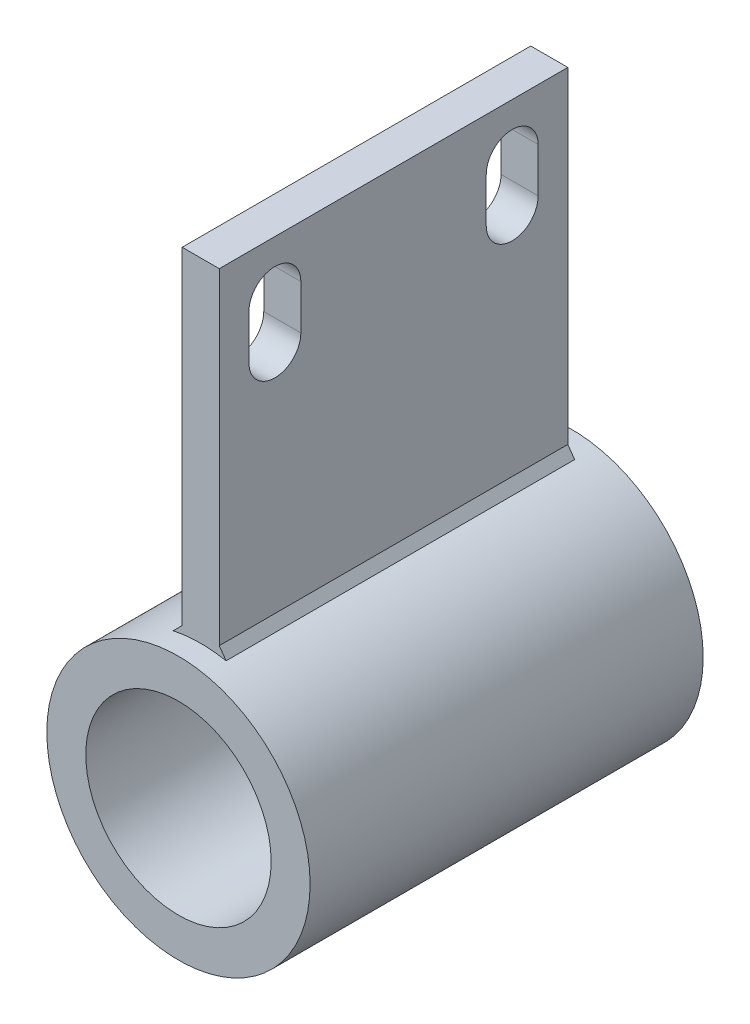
ISO-10303-21;
HEADER;
FILE_DESCRIPTION(('STEP AP214'),'2;1');
FILE_NAME('part.step','',(''),(''),'','','');
FILE_SCHEMA(('AUTOMOTIVE_DESIGN { 1 0 10303 214 1 1 1 1 }'));
ENDSEC;
DATA;
#1=APPLICATION_CONTEXT('core data for automotive mechanical design processes');
#2=APPLICATION_PROTOCOL_DEFINITION('international standard','automotive_design',2000,#1);
#3=PRODUCT_CONTEXT('',#1,'mechanical');
#4=PRODUCT('Part','Part','',(#3));
#5=PRODUCT_RELATED_PRODUCT_CATEGORY('part','',(#4));
#6=PRODUCT_DEFINITION_FORMATION('','',#4);
#7=PRODUCT_DEFINITION_CONTEXT('part definition',#1,'design');
#8=PRODUCT_DEFINITION('design','',#6,#7);
#9=PRODUCT_DEFINITION_SHAPE('','',#8);
#10=(LENGTH_UNIT() NAMED_UNIT(*) SI_UNIT(.MILLI.,.METRE.));
#11=(NAMED_UNIT(*) PLANE_ANGLE_UNIT() SI_UNIT($,.RADIAN.));
#12=(NAMED_UNIT(*) SI_UNIT($,.STERADIAN.) SOLID_ANGLE_UNIT());
#13=UNCERTAINTY_MEASURE_WITH_UNIT(LENGTH_MEASURE(1.E-05),#10,'distance_accuracy_value','');
#14=(GEOMETRIC_REPRESENTATION_CONTEXT(3) GLOBAL_UNCERTAINTY_ASSIGNED_CONTEXT((#13)) GLOBAL_UNIT_ASSIGNED_CONTEXT((#10,
#11,#12)) REPRESENTATION_CONTEXT('',''));
#15=CARTESIAN_POINT('',(0.,0.,0.));
#16=DIRECTION('',(0.,0.,1.));
#17=DIRECTION('',(1.,0.,0.));
#18=AXIS2_PLACEMENT_3D('',#15,#16,#17);
#19=CARTESIAN_POINT('',(4.99999999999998,125.5,106.));
#20=DIRECTION('',(-1.,0.,0.));
#21=DIRECTION('',(0.,-1.,0.));
#22=AXIS2_PLACEMENT_3D('',#19,#20,#21);
#23=PLANE('',#22);
#24=CARTESIAN_POINT('',(5.00000000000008,99.5,21.));
#25=DIRECTION('',(-1.,0.,0.));
#26=DIRECTION('',(0.,-1.,0.));
#27=AXIS2_PLACEMENT_3D('',#24,#25,#26);
#28=CIRCLE('',#27,7.);
#29=CARTESIAN_POINT('',(5.0000000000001,99.5,14.));
#30=VERTEX_POINT('',#29);
#31=CARTESIAN_POINT('',(5.00000000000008,99.5,28.));
#32=VERTEX_POINT('',#31);
#33=EDGE_CURVE('E164',#30,#32,#28,.T.);
#34=ORIENTED_EDGE('',*,*,#33,.T.);
#35=DIRECTION('',(0.,1.,0.));
#36=VECTOR('',#35,1.);
#37=CARTESIAN_POINT('',(4.99999999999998,125.5,28.));
#38=LINE('',#37,#36);
#39=CARTESIAN_POINT('',(5.00000000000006,111.5,28.));
#40=VERTEX_POINT('',#39);
#41=EDGE_CURVE('E173',#32,#40,#38,.T.);
#42=ORIENTED_EDGE('',*,*,#41,.T.);
#43=CARTESIAN_POINT('',(5.00000000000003,111.5,21.));
#44=DIRECTION('',(-1.,0.,0.));
#45=DIRECTION('',(0.,-1.,0.));
#46=AXIS2_PLACEMENT_3D('',#43,#44,#45);
#47=CIRCLE('',#46,7.);
#48=CARTESIAN_POINT('',(5.00000000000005,111.5,14.));
#49=VERTEX_POINT('',#48);
#50=EDGE_CURVE('E171',#40,#49,#47,.T.);
#51=ORIENTED_EDGE('',*,*,#50,.T.);
#52=DIRECTION('',(0.,-1.,0.));
#53=VECTOR('',#52,1.);
#54=CARTESIAN_POINT('',(4.99999999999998,125.5,14.));
#55=LINE('',#54,#53);
#56=EDGE_CURVE('E139',#49,#30,#55,.T.);
#57=ORIENTED_EDGE('',*,*,#56,.T.);
#58=EDGE_LOOP('',(#34,#42,#51,#57));
#59=FACE_BOUND('',#58,.T.);
#60=CARTESIAN_POINT('',(5.00000000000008,99.5,85.));
#61=DIRECTION('',(-1.,0.,0.));
#62=DIRECTION('',(0.,-1.,0.));
#63=AXIS2_PLACEMENT_3D('',#60,#61,#62);
#64=CIRCLE('',#63,7.00000000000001);
#65=CARTESIAN_POINT('',(5.0000000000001,99.5,78.));
#66=VERTEX_POINT('',#65);
#67=CARTESIAN_POINT('',(5.00000000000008,99.5,92.));
#68=VERTEX_POINT('',#67);
#69=EDGE_CURVE('E190',#66,#68,#64,.T.);
#70=ORIENTED_EDGE('',*,*,#69,.T.);
#71=DIRECTION('',(0.,1.,0.));
#72=VECTOR('',#71,1.);
#73=CARTESIAN_POINT('',(4.99999999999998,125.5,92.));
#74=LINE('',#73,#72);
#75=CARTESIAN_POINT('',(5.00000000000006,111.5,92.));
#76=VERTEX_POINT('',#75);
#77=EDGE_CURVE('E202',#68,#76,#74,.T.);
#78=ORIENTED_EDGE('',*,*,#77,.T.);
#79=CARTESIAN_POINT('',(5.00000000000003,111.5,85.));
#80=DIRECTION('',(-1.,0.,0.));
#81=DIRECTION('',(0.,-1.,0.));
#82=AXIS2_PLACEMENT_3D('',#79,#80,#81);
#83=CIRCLE('',#82,7.00000000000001);
#84=CARTESIAN_POINT('',(5.00000000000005,111.5,78.));
#85=VERTEX_POINT('',#84);
#86=EDGE_CURVE('E205',#76,#85,#83,.T.);
#87=ORIENTED_EDGE('',*,*,#86,.T.);
#88=DIRECTION('',(0.,-1.,0.));
#89=VECTOR('',#88,1.);
#90=CARTESIAN_POINT('',(4.99999999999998,125.5,78.));
#91=LINE('',#90,#89);
#92=EDGE_CURVE('E199',#85,#66,#91,.T.);
#93=ORIENTED_EDGE('',*,*,#92,.T.);
#94=EDGE_LOOP('',(#70,#78,#87,#93));
#95=FACE_BOUND('',#94,.T.);
#96=DIRECTION('',(0.,1.,0.));
#97=VECTOR('',#96,1.);
#98=CARTESIAN_POINT('',(4.99999999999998,125.5,100.));
#99=LINE('',#98,#97);
#100=CARTESIAN_POINT('',(4.99999999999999,37.4479491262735,100.));
#101=VERTEX_POINT('',#100);
#102=CARTESIAN_POINT('',(4.99999999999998,125.5,100.));
#103=VERTEX_POINT('',#102);
#104=EDGE_CURVE('E222',#101,#103,#99,.T.);
#105=ORIENTED_EDGE('',*,*,#104,.F.);
#106=DIRECTION('',(0.,0.,-1.));
#107=VECTOR('',#106,1.);
#108=CARTESIAN_POINT('',(5.0000000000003,37.4479491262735,6.));
#109=LINE('',#108,#107);
#110=CARTESIAN_POINT('',(5.00000000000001,37.4479491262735,6.));
#111=VERTEX_POINT('',#110);
#112=EDGE_CURVE('E252',#101,#111,#109,.T.);
#113=ORIENTED_EDGE('',*,*,#112,.T.);
#114=DIRECTION('',(0.,-1.,0.));
#115=VECTOR('',#114,1.);
#116=CARTESIAN_POINT('',(5.00000000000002,125.5,6.));
#117=LINE('',#116,#115);
#118=CARTESIAN_POINT('',(5.00000000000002,125.5,6.));
#119=VERTEX_POINT('',#118);
#120=EDGE_CURVE('E208',#119,#111,#117,.T.);
#121=ORIENTED_EDGE('',*,*,#120,.F.);
#122=DIRECTION('',(0.,0.,-1.));
#123=VECTOR('',#122,1.);
#124=CARTESIAN_POINT('',(4.99999999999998,125.5,106.));
#125=LINE('',#124,#123);
#126=EDGE_CURVE('E241',#103,#119,#125,.T.);
#127=ORIENTED_EDGE('',*,*,#126,.F.);
#128=EDGE_LOOP('',(#105,#113,#121,#127));
#129=FACE_BOUND('',#128,.T.);
#130=ADVANCED_FACE('F32',(#59,#95,#129),#23,.F.);
#131=CARTESIAN_POINT('',(-5.00000000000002,125.5,106.));
#132=DIRECTION('',(0.,-1.,0.));
#133=DIRECTION('',(0.,0.,-1.));
#134=AXIS2_PLACEMENT_3D('',#131,#132,#133);
#135=PLANE('',#134);
#136=DIRECTION('',(1.,0.,0.));
#137=VECTOR('',#136,1.);
#138=CARTESIAN_POINT('',(5.00000000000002,125.5,6.));
#139=LINE('',#138,#137);
#140=CARTESIAN_POINT('',(-4.99999999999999,125.5,6.));
#141=VERTEX_POINT('',#140);
#142=EDGE_CURVE('E215',#141,#119,#139,.T.);
#143=ORIENTED_EDGE('',*,*,#142,.F.);
#144=DIRECTION('',(0.,0.,-1.));
#145=VECTOR('',#144,1.);
#146=CARTESIAN_POINT('',(-5.00000000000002,125.5,106.));
#147=LINE('',#146,#145);
#148=CARTESIAN_POINT('',(-5.00000000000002,125.5,100.));
#149=VERTEX_POINT('',#148);
#150=EDGE_CURVE('E238',#149,#141,#147,.T.);
#151=ORIENTED_EDGE('',*,*,#150,.F.);
#152=DIRECTION('',(-1.,0.,0.));
#153=VECTOR('',#152,1.);
#154=CARTESIAN_POINT('',(-5.00000000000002,125.5,100.));
#155=LINE('',#154,#153);
#156=EDGE_CURVE('E224',#103,#149,#155,.T.);
#157=ORIENTED_EDGE('',*,*,#156,.F.);
#158=ORIENTED_EDGE('',*,*,#126,.T.);
#159=EDGE_LOOP('',(#143,#151,#157,#158));
#160=FACE_BOUND('',#159,.T.);
#161=ADVANCED_FACE('F277',(#160),#135,.F.);
#162=CARTESIAN_POINT('',(-5.00000000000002,125.5,106.));
#163=DIRECTION('',(1.,0.,0.));
#164=DIRECTION('',(0.,1.,0.));
#165=AXIS2_PLACEMENT_3D('',#162,#163,#164);
#166=PLANE('',#165);
#167=CARTESIAN_POINT('',(-5.00000000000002,111.5,21.));
#168=DIRECTION('',(-1.,0.,0.));
#169=DIRECTION('',(0.,-1.,0.));
#170=AXIS2_PLACEMENT_3D('',#167,#168,#169);
#171=CIRCLE('',#170,7.);
#172=CARTESIAN_POINT('',(-5.00000000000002,111.5,28.));
#173=VERTEX_POINT('',#172);
#174=CARTESIAN_POINT('',(-5.00000000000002,111.5,14.));
#175=VERTEX_POINT('',#174);
#176=EDGE_CURVE('E146',#173,#175,#171,.T.);
#177=ORIENTED_EDGE('',*,*,#176,.F.);
#178=DIRECTION('',(0.,1.,0.));
#179=VECTOR('',#178,1.);
#180=CARTESIAN_POINT('',(-5.00000000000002,111.5,28.));
#181=LINE('',#180,#179);
#182=CARTESIAN_POINT('',(-5.00000000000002,99.5,28.));
#183=VERTEX_POINT('',#182);
#184=EDGE_CURVE('E143',#183,#173,#181,.T.);
#185=ORIENTED_EDGE('',*,*,#184,.F.);
#186=CARTESIAN_POINT('',(-5.00000000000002,99.5,21.));
#187=DIRECTION('',(-1.,0.,0.));
#188=DIRECTION('',(0.,-1.,0.));
#189=AXIS2_PLACEMENT_3D('',#186,#187,#188);
#190=CIRCLE('',#189,7.);
#191=CARTESIAN_POINT('',(-5.00000000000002,99.5,14.));
#192=VERTEX_POINT('',#191);
#193=EDGE_CURVE('E158',#192,#183,#190,.T.);
#194=ORIENTED_EDGE('',*,*,#193,.F.);
#195=DIRECTION('',(0.,-1.,0.));
#196=VECTOR('',#195,1.);
#197=CARTESIAN_POINT('',(-5.00000000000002,111.5,14.));
#198=LINE('',#197,#196);
#199=EDGE_CURVE('E136',#175,#192,#198,.T.);
#200=ORIENTED_EDGE('',*,*,#199,.F.);
#201=EDGE_LOOP('',(#177,#185,#194,#200));
#202=FACE_BOUND('',#201,.T.);
#203=DIRECTION('',(0.,-1.,0.));
#204=VECTOR('',#203,1.);
#205=CARTESIAN_POINT('',(-5.00000000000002,111.5,78.));
#206=LINE('',#205,#204);
#207=CARTESIAN_POINT('',(-5.00000000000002,111.5,78.));
#208=VERTEX_POINT('',#207);
#209=CARTESIAN_POINT('',(-5.00000000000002,99.5,78.));
#210=VERTEX_POINT('',#209);
#211=EDGE_CURVE('E179',#208,#210,#206,.T.);
#212=ORIENTED_EDGE('',*,*,#211,.F.);
#213=CARTESIAN_POINT('',(-5.00000000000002,111.5,85.));
#214=DIRECTION('',(-1.,0.,0.));
#215=DIRECTION('',(0.,-1.,0.));
#216=AXIS2_PLACEMENT_3D('',#213,#214,#215);
#217=CIRCLE('',#216,7.00000000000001);
#218=CARTESIAN_POINT('',(-5.00000000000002,111.5,92.));
#219=VERTEX_POINT('',#218);
#220=EDGE_CURVE('E176',#219,#208,#217,.T.);
#221=ORIENTED_EDGE('',*,*,#220,.F.);
#222=DIRECTION('',(0.,1.,0.));
#223=VECTOR('',#222,1.);
#224=CARTESIAN_POINT('',(-5.00000000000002,111.5,92.));
#225=LINE('',#224,#223);
#226=CARTESIAN_POINT('',(-5.00000000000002,99.5,92.));
#227=VERTEX_POINT('',#226);
#228=EDGE_CURVE('E184',#227,#219,#225,.T.);
#229=ORIENTED_EDGE('',*,*,#228,.F.);
#230=CARTESIAN_POINT('',(-5.00000000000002,99.5,85.));
#231=DIRECTION('',(-1.,0.,0.));
#232=DIRECTION('',(0.,-1.,0.));
#233=AXIS2_PLACEMENT_3D('',#230,#231,#232);
#234=CIRCLE('',#233,7.00000000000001);
#235=EDGE_CURVE('E181',#210,#227,#234,.T.);
#236=ORIENTED_EDGE('',*,*,#235,.F.);
#237=EDGE_LOOP('',(#212,#221,#229,#236));
#238=FACE_BOUND('',#237,.T.);
#239=DIRECTION('',(0.,1.,0.));
#240=VECTOR('',#239,1.);
#241=CARTESIAN_POINT('',(-4.99999999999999,125.5,6.));
#242=LINE('',#241,#240);
#243=CARTESIAN_POINT('',(-5.,37.14612354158,6.));
#244=VERTEX_POINT('',#243);
#245=EDGE_CURVE('E213',#244,#141,#242,.T.);
#246=ORIENTED_EDGE('',*,*,#245,.F.);
#247=DIRECTION('',(0.,0.,1.));
#248=VECTOR('',#247,1.);
#249=CARTESIAN_POINT('',(-5.00000000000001,37.14612354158,100.));
#250=LINE('',#249,#248);
#251=CARTESIAN_POINT('',(-5.00000000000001,37.14612354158,100.));
#252=VERTEX_POINT('',#251);
#253=EDGE_CURVE('E250',#244,#252,#250,.T.);
#254=ORIENTED_EDGE('',*,*,#253,.T.);
#255=DIRECTION('',(0.,-1.,0.));
#256=VECTOR('',#255,1.);
#257=CARTESIAN_POINT('',(-5.00000000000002,125.5,100.));
#258=LINE('',#257,#256);
#259=EDGE_CURVE('E217',#149,#252,#258,.T.);
#260=ORIENTED_EDGE('',*,*,#259,.F.);
#261=ORIENTED_EDGE('',*,*,#150,.T.);
#262=EDGE_LOOP('',(#246,#254,#260,#261));
#263=FACE_BOUND('',#262,.T.);
#264=ADVANCED_FACE('F155',(#202,#238,#263),#166,.F.);
#265=CARTESIAN_POINT('',(0.,0.,106.));
#266=DIRECTION('',(0.,0.,1.));
#267=DIRECTION('',(1.,0.,0.));
#268=AXIS2_PLACEMENT_3D('',#265,#266,#267);
#269=PLANE('',#268);
#270=CARTESIAN_POINT('',(0.,0.,106.));
#271=DIRECTION('',(0.,0.,1.));
#272=DIRECTION('',(1.,0.,0.));
#273=AXIS2_PLACEMENT_3D('',#270,#271,#272);
#274=CIRCLE('',#273,35.5);
#275=CARTESIAN_POINT('',(35.5,0.,106.));
#276=VERTEX_POINT('',#275);
#277=EDGE_CURVE('E235',#276,#276,#274,.T.);
#278=ORIENTED_EDGE('',*,*,#277,.T.);
#279=EDGE_LOOP('',(#278));
#280=FACE_BOUND('',#279,.T.);
#281=CARTESIAN_POINT('',(0.,0.,106.));
#282=DIRECTION('',(0.,0.,1.));
#283=DIRECTION('',(1.,0.,0.));
#284=AXIS2_PLACEMENT_3D('',#281,#282,#283);
#285=CIRCLE('',#284,25.);
#286=CARTESIAN_POINT('',(25.,0.,106.));
#287=VERTEX_POINT('',#286);
#288=EDGE_CURVE('E229',#287,#287,#285,.T.);
#289=ORIENTED_EDGE('',*,*,#288,.F.);
#290=EDGE_LOOP('',(#289));
#291=FACE_BOUND('',#290,.T.);
#292=ADVANCED_FACE('F302',(#280,#291),#269,.T.);
#293=CARTESIAN_POINT('',(0.,0.,0.));
#294=DIRECTION('',(0.,0.,1.));
#295=DIRECTION('',(1.,0.,0.));
#296=AXIS2_PLACEMENT_3D('',#293,#294,#295);
#297=PLANE('',#296);
#298=CARTESIAN_POINT('',(0.,0.,0.));
#299=DIRECTION('',(0.,0.,1.));
#300=DIRECTION('',(1.,0.,0.));
#301=AXIS2_PLACEMENT_3D('',#298,#299,#300);
#302=CIRCLE('',#301,35.5);
#303=CARTESIAN_POINT('',(35.5,0.,0.));
#304=VERTEX_POINT('',#303);
#305=EDGE_CURVE('E232',#304,#304,#302,.T.);
#306=ORIENTED_EDGE('',*,*,#305,.F.);
#307=EDGE_LOOP('',(#306));
#308=FACE_BOUND('',#307,.T.);
#309=CARTESIAN_POINT('',(0.,0.,0.));
#310=DIRECTION('',(0.,0.,1.));
#311=DIRECTION('',(1.,0.,0.));
#312=AXIS2_PLACEMENT_3D('',#309,#310,#311);
#313=CIRCLE('',#312,25.);
#314=CARTESIAN_POINT('',(25.,0.,0.));
#315=VERTEX_POINT('',#314);
#316=EDGE_CURVE('E226',#315,#315,#313,.T.);
#317=ORIENTED_EDGE('',*,*,#316,.T.);
#318=EDGE_LOOP('',(#317));
#319=FACE_BOUND('',#318,.T.);
#320=ADVANCED_FACE('F305',(#308,#319),#297,.F.);
#321=CARTESIAN_POINT('',(0.,0.,106.));
#322=DIRECTION('',(0.,0.,-1.));
#323=DIRECTION('',(-1.,0.,0.));
#324=AXIS2_PLACEMENT_3D('',#321,#322,#323);
#325=CYLINDRICAL_SURFACE('',#324,35.5);
#326=ORIENTED_EDGE('',*,*,#305,.T.);
#327=EDGE_LOOP('',(#326));
#328=FACE_BOUND('',#327,.T.);
#329=DIRECTION('',(0.,0.,-1.));
#330=VECTOR('',#329,1.);
#331=CARTESIAN_POINT('',(-7.43300797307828,34.7131155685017,106.));
#332=LINE('',#331,#330);
#333=CARTESIAN_POINT('',(-7.43300797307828,34.7131155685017,100.));
#334=VERTEX_POINT('',#333);
#335=CARTESIAN_POINT('',(-7.43300797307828,34.7131155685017,6.));
#336=VERTEX_POINT('',#335);
#337=EDGE_CURVE('E247',#334,#336,#332,.T.);
#338=ORIENTED_EDGE('',*,*,#337,.T.);
#339=CARTESIAN_POINT('',(0.,0.,6.));
#340=DIRECTION('',(0.,0.,1.));
#341=DIRECTION('',(-1.,0.,0.));
#342=AXIS2_PLACEMENT_3D('',#339,#340,#341);
#343=CIRCLE('',#342,35.5);
#344=CARTESIAN_POINT('',(6.84187420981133,34.8344478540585,6.));
#345=VERTEX_POINT('',#344);
#346=EDGE_CURVE('E211',#345,#336,#343,.T.);
#347=ORIENTED_EDGE('',*,*,#346,.F.);
#348=DIRECTION('',(0.,0.,-1.));
#349=VECTOR('',#348,1.);
#350=CARTESIAN_POINT('',(6.84187420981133,34.8344478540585,106.));
#351=LINE('',#350,#349);
#352=CARTESIAN_POINT('',(6.84187420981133,34.8344478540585,100.));
#353=VERTEX_POINT('',#352);
#354=EDGE_CURVE('E244',#345,#353,#351,.F.);
#355=ORIENTED_EDGE('',*,*,#354,.T.);
#356=CARTESIAN_POINT('',(0.,0.,100.));
#357=DIRECTION('',(0.,0.,-1.));
#358=DIRECTION('',(1.,0.,0.));
#359=AXIS2_PLACEMENT_3D('',#356,#357,#358);
#360=CIRCLE('',#359,35.5);
#361=EDGE_CURVE('E220',#334,#353,#360,.T.);
#362=ORIENTED_EDGE('',*,*,#361,.F.);
#363=EDGE_LOOP('',(#338,#347,#355,#362));
#364=FACE_BOUND('',#363,.T.);
#365=ORIENTED_EDGE('',*,*,#277,.F.);
#366=EDGE_LOOP('',(#365));
#367=FACE_BOUND('',#366,.T.);
#368=ADVANCED_FACE('F34',(#328,#364,#367),#325,.T.);
#369=CARTESIAN_POINT('',(0.,0.,106.));
#370=DIRECTION('',(0.,0.,-1.));
#371=DIRECTION('',(-1.,0.,0.));
#372=AXIS2_PLACEMENT_3D('',#369,#370,#371);
#373=CYLINDRICAL_SURFACE('',#372,25.);
#374=ORIENTED_EDGE('',*,*,#288,.T.);
#375=EDGE_LOOP('',(#374));
#376=FACE_BOUND('',#375,.T.);
#377=ORIENTED_EDGE('',*,*,#316,.F.);
#378=EDGE_LOOP('',(#377));
#379=FACE_BOUND('',#378,.T.);
#380=ADVANCED_FACE('F282',(#376,#379),#373,.F.);
#381=CARTESIAN_POINT('',(0.,0.,100.));
#382=DIRECTION('',(0.,0.,1.));
#383=DIRECTION('',(1.,0.,0.));
#384=AXIS2_PLACEMENT_3D('',#381,#382,#383);
#385=PLANE('',#384);
#386=ORIENTED_EDGE('',*,*,#259,.T.);
#387=DIRECTION('',(-0.70710678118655,-0.707106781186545,0.));
#388=VECTOR('',#387,1.);
#389=CARTESIAN_POINT('',(-7.43300797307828,34.7131155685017,100.));
#390=LINE('',#389,#388);
#391=EDGE_CURVE('E256',#252,#334,#390,.T.);
#392=ORIENTED_EDGE('',*,*,#391,.T.);
#393=ORIENTED_EDGE('',*,*,#361,.T.);
#394=DIRECTION('',(-0.576067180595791,0.817402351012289,0.));
#395=VECTOR('',#394,1.);
#396=CARTESIAN_POINT('',(5.0000000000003,37.4479491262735,100.));
#397=LINE('',#396,#395);
#398=EDGE_CURVE('E11',#353,#101,#397,.T.);
#399=ORIENTED_EDGE('',*,*,#398,.T.);
#400=ORIENTED_EDGE('',*,*,#104,.T.);
#401=ORIENTED_EDGE('',*,*,#156,.T.);
#402=EDGE_LOOP('',(#386,#392,#393,#399,#400,#401));
#403=FACE_BOUND('',#402,.T.);
#404=ADVANCED_FACE('F280',(#403),#385,.T.);
#405=CARTESIAN_POINT('',(0.,0.,6.));
#406=DIRECTION('',(0.,0.,-1.));
#407=DIRECTION('',(-1.,0.,0.));
#408=AXIS2_PLACEMENT_3D('',#405,#406,#407);
#409=PLANE('',#408);
#410=ORIENTED_EDGE('',*,*,#120,.T.);
#411=DIRECTION('',(0.576067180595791,-0.817402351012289,0.));
#412=VECTOR('',#411,1.);
#413=CARTESIAN_POINT('',(5.0000000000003,37.4479491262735,6.00000000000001));
#414=LINE('',#413,#412);
#415=EDGE_CURVE('E40',#111,#345,#414,.T.);
#416=ORIENTED_EDGE('',*,*,#415,.T.);
#417=ORIENTED_EDGE('',*,*,#346,.T.);
#418=DIRECTION('',(0.70710678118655,0.707106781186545,0.));
#419=VECTOR('',#418,1.);
#420=CARTESIAN_POINT('',(-7.43300797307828,34.7131155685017,6.00000000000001));
#421=LINE('',#420,#419);
#422=EDGE_CURVE('E254',#336,#244,#421,.T.);
#423=ORIENTED_EDGE('',*,*,#422,.T.);
#424=ORIENTED_EDGE('',*,*,#245,.T.);
#425=ORIENTED_EDGE('',*,*,#142,.T.);
#426=EDGE_LOOP('',(#410,#416,#417,#423,#424,#425));
#427=FACE_BOUND('',#426,.T.);
#428=ADVANCED_FACE('F259',(#427),#409,.T.);
#429=CARTESIAN_POINT('',(35.5,111.5,85.));
#430=DIRECTION('',(-1.,0.,0.));
#431=DIRECTION('',(0.,-1.,0.));
#432=AXIS2_PLACEMENT_3D('',#429,#430,#431);
#433=CYLINDRICAL_SURFACE('',#432,7.00000000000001);
#434=DIRECTION('',(-1.,0.,0.));
#435=VECTOR('',#434,1.);
#436=CARTESIAN_POINT('',(35.5,111.5,92.));
#437=LINE('',#436,#435);
#438=EDGE_CURVE('E188',#76,#219,#437,.T.);
#439=ORIENTED_EDGE('',*,*,#438,.T.);
#440=ORIENTED_EDGE('',*,*,#220,.T.);
#441=DIRECTION('',(-1.,0.,0.));
#442=VECTOR('',#441,1.);
#443=CARTESIAN_POINT('',(35.5,111.5,78.));
#444=LINE('',#443,#442);
#445=EDGE_CURVE('E187',#85,#208,#444,.T.);
#446=ORIENTED_EDGE('',*,*,#445,.F.);
#447=ORIENTED_EDGE('',*,*,#86,.F.);
#448=EDGE_LOOP('',(#439,#440,#446,#447));
#449=FACE_BOUND('',#448,.T.);
#450=ADVANCED_FACE('F288',(#449),#433,.F.);
#451=CARTESIAN_POINT('',(35.5,111.5,92.));
#452=DIRECTION('',(0.,0.,1.));
#453=DIRECTION('',(1.,0.,0.));
#454=AXIS2_PLACEMENT_3D('',#451,#452,#453);
#455=PLANE('',#454);
#456=DIRECTION('',(-1.,0.,0.));
#457=VECTOR('',#456,1.);
#458=CARTESIAN_POINT('',(35.5,99.5,92.));
#459=LINE('',#458,#457);
#460=EDGE_CURVE('E191',#68,#227,#459,.T.);
#461=ORIENTED_EDGE('',*,*,#460,.T.);
#462=ORIENTED_EDGE('',*,*,#228,.T.);
#463=ORIENTED_EDGE('',*,*,#438,.F.);
#464=ORIENTED_EDGE('',*,*,#77,.F.);
#465=EDGE_LOOP('',(#461,#462,#463,#464));
#466=FACE_BOUND('',#465,.T.);
#467=ADVANCED_FACE('F345',(#466),#455,.F.);
#468=CARTESIAN_POINT('',(35.5,111.5,78.));
#469=DIRECTION('',(0.,0.,-1.));
#470=DIRECTION('',(0.,1.,0.));
#471=AXIS2_PLACEMENT_3D('',#468,#469,#470);
#472=PLANE('',#471);
#473=ORIENTED_EDGE('',*,*,#445,.T.);
#474=ORIENTED_EDGE('',*,*,#211,.T.);
#475=DIRECTION('',(-1.,0.,0.));
#476=VECTOR('',#475,1.);
#477=CARTESIAN_POINT('',(35.5,99.5,78.));
#478=LINE('',#477,#476);
#479=EDGE_CURVE('E193',#66,#210,#478,.T.);
#480=ORIENTED_EDGE('',*,*,#479,.F.);
#481=ORIENTED_EDGE('',*,*,#92,.F.);
#482=EDGE_LOOP('',(#473,#474,#480,#481));
#483=FACE_BOUND('',#482,.T.);
#484=ADVANCED_FACE('F355',(#483),#472,.F.);
#485=CARTESIAN_POINT('',(35.5,99.5,85.));
#486=DIRECTION('',(-1.,0.,0.));
#487=DIRECTION('',(0.,-1.,0.));
#488=AXIS2_PLACEMENT_3D('',#485,#486,#487);
#489=CYLINDRICAL_SURFACE('',#488,7.00000000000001);
#490=ORIENTED_EDGE('',*,*,#479,.T.);
#491=ORIENTED_EDGE('',*,*,#235,.T.);
#492=ORIENTED_EDGE('',*,*,#460,.F.);
#493=ORIENTED_EDGE('',*,*,#69,.F.);
#494=EDGE_LOOP('',(#490,#491,#492,#493));
#495=FACE_BOUND('',#494,.T.);
#496=ADVANCED_FACE('F365',(#495),#489,.F.);
#497=CARTESIAN_POINT('',(35.5,111.5,28.));
#498=DIRECTION('',(0.,0.,1.));
#499=DIRECTION('',(1.,0.,0.));
#500=AXIS2_PLACEMENT_3D('',#497,#498,#499);
#501=PLANE('',#500);
#502=DIRECTION('',(-1.,0.,0.));
#503=VECTOR('',#502,1.);
#504=CARTESIAN_POINT('',(35.5,99.5,28.));
#505=LINE('',#504,#503);
#506=EDGE_CURVE('E165',#32,#183,#505,.T.);
#507=ORIENTED_EDGE('',*,*,#506,.T.);
#508=ORIENTED_EDGE('',*,*,#184,.T.);
#509=DIRECTION('',(-1.,0.,0.));
#510=VECTOR('',#509,1.);
#511=CARTESIAN_POINT('',(35.5,111.5,28.));
#512=LINE('',#511,#510);
#513=EDGE_CURVE('E149',#40,#173,#512,.T.);
#514=ORIENTED_EDGE('',*,*,#513,.F.);
#515=ORIENTED_EDGE('',*,*,#41,.F.);
#516=EDGE_LOOP('',(#507,#508,#514,#515));
#517=FACE_BOUND('',#516,.T.);
#518=ADVANCED_FACE('F375',(#517),#501,.F.);
#519=CARTESIAN_POINT('',(35.5,111.5,21.));
#520=DIRECTION('',(-1.,0.,0.));
#521=DIRECTION('',(0.,-1.,0.));
#522=AXIS2_PLACEMENT_3D('',#519,#520,#521);
#523=CYLINDRICAL_SURFACE('',#522,7.);
#524=ORIENTED_EDGE('',*,*,#513,.T.);
#525=ORIENTED_EDGE('',*,*,#176,.T.);
#526=DIRECTION('',(-1.,0.,0.));
#527=VECTOR('',#526,1.);
#528=CARTESIAN_POINT('',(35.5,111.5,14.));
#529=LINE('',#528,#527);
#530=EDGE_CURVE('E131',#49,#175,#529,.T.);
#531=ORIENTED_EDGE('',*,*,#530,.F.);
#532=ORIENTED_EDGE('',*,*,#50,.F.);
#533=EDGE_LOOP('',(#524,#525,#531,#532));
#534=FACE_BOUND('',#533,.T.);
#535=ADVANCED_FACE('F147',(#534),#523,.F.);
#536=CARTESIAN_POINT('',(35.5,111.5,14.));
#537=DIRECTION('',(0.,0.,-1.));
#538=DIRECTION('',(0.,1.,0.));
#539=AXIS2_PLACEMENT_3D('',#536,#537,#538);
#540=PLANE('',#539);
#541=ORIENTED_EDGE('',*,*,#530,.T.);
#542=ORIENTED_EDGE('',*,*,#199,.T.);
#543=DIRECTION('',(-1.,0.,0.));
#544=VECTOR('',#543,1.);
#545=CARTESIAN_POINT('',(35.5,99.5,14.));
#546=LINE('',#545,#544);
#547=EDGE_CURVE('E142',#30,#192,#546,.T.);
#548=ORIENTED_EDGE('',*,*,#547,.F.);
#549=ORIENTED_EDGE('',*,*,#56,.F.);
#550=EDGE_LOOP('',(#541,#542,#548,#549));
#551=FACE_BOUND('',#550,.T.);
#552=ADVANCED_FACE('F133',(#551),#540,.F.);
#553=CARTESIAN_POINT('',(35.5,99.5,21.));
#554=DIRECTION('',(-1.,0.,0.));
#555=DIRECTION('',(0.,-1.,0.));
#556=AXIS2_PLACEMENT_3D('',#553,#554,#555);
#557=CYLINDRICAL_SURFACE('',#556,7.);
#558=ORIENTED_EDGE('',*,*,#547,.T.);
#559=ORIENTED_EDGE('',*,*,#193,.T.);
#560=ORIENTED_EDGE('',*,*,#506,.F.);
#561=ORIENTED_EDGE('',*,*,#33,.F.);
#562=EDGE_LOOP('',(#558,#559,#560,#561));
#563=FACE_BOUND('',#562,.T.);
#564=ADVANCED_FACE('F402',(#563),#557,.F.);
#565=CARTESIAN_POINT('',(-7.43300797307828,34.7131155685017,106.));
#566=DIRECTION('',(0.707106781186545,-0.70710678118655,0.));
#567=DIRECTION('',(0.70710678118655,0.707106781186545,0.));
#568=AXIS2_PLACEMENT_3D('',#565,#566,#567);
#569=PLANE('',#568);
#570=ORIENTED_EDGE('',*,*,#391,.F.);
#571=ORIENTED_EDGE('',*,*,#253,.F.);
#572=ORIENTED_EDGE('',*,*,#422,.F.);
#573=ORIENTED_EDGE('',*,*,#337,.F.);
#574=EDGE_LOOP('',(#570,#571,#572,#573));
#575=FACE_BOUND('',#574,.T.);
#576=ADVANCED_FACE('F268',(#575),#569,.F.);
#577=CARTESIAN_POINT('',(5.0000000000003,37.4479491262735,106.));
#578=DIRECTION('',(-0.817402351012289,-0.576067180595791,0.));
#579=DIRECTION('',(0.576067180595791,-0.817402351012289,0.));
#580=AXIS2_PLACEMENT_3D('',#577,#578,#579);
#581=PLANE('',#580);
#582=ORIENTED_EDGE('',*,*,#398,.F.);
#583=ORIENTED_EDGE('',*,*,#354,.F.);
#584=ORIENTED_EDGE('',*,*,#415,.F.);
#585=ORIENTED_EDGE('',*,*,#112,.F.);
#586=EDGE_LOOP('',(#582,#583,#584,#585));
#587=FACE_BOUND('',#586,.T.);
#588=ADVANCED_FACE('F262',(#587),#581,.F.);
#589=CLOSED_SHELL('',(#130,#161,#264,#292,#320,#368,#380,#404,#428,#450,#467,#484,#496,#518,
#535,#552,#564,#576,#588));
#590=MANIFOLD_SOLID_BREP('B2',#589);
#591=ADVANCED_BREP_SHAPE_REPRESENTATION('',(#18,#590),#14);
#592=SHAPE_DEFINITION_REPRESENTATION(#9,#591);
ENDSEC;
END-ISO-10303-21;
